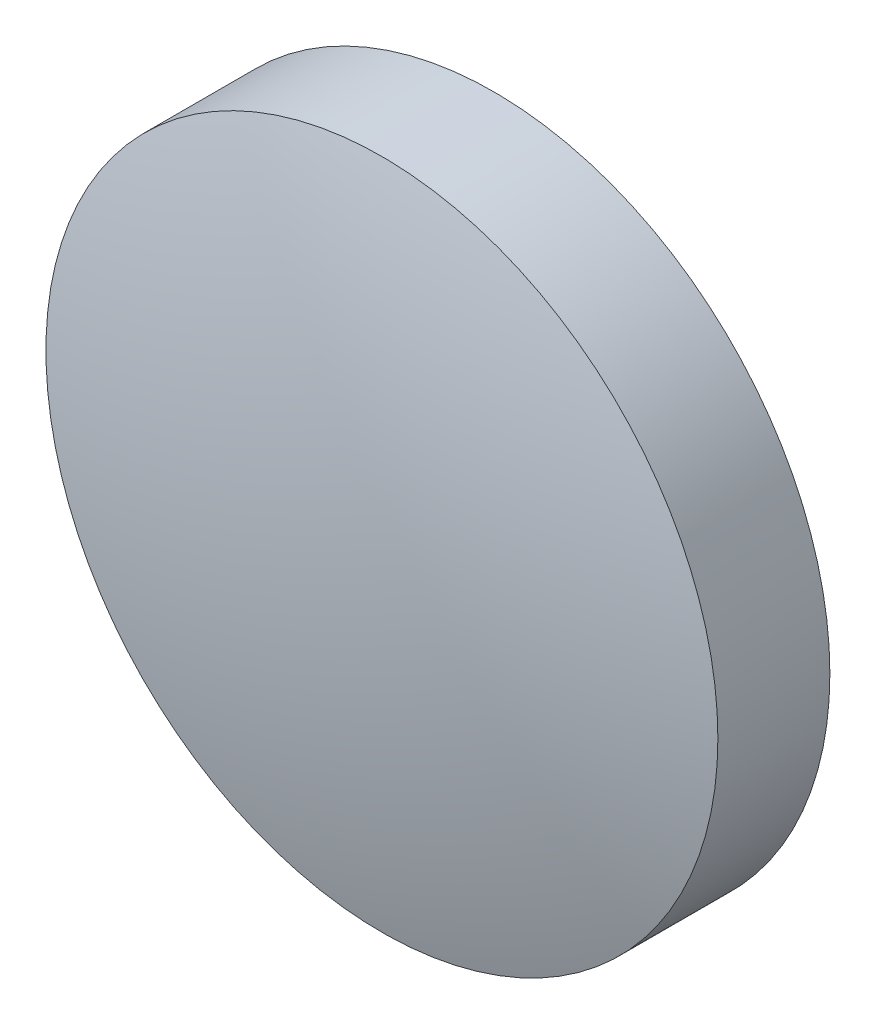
from build123d import *

# Parameters (mm, degrees)
SKIZZE1_R                       = 15
AUFSATZ_LINEAR_AUSTRAGEN1_DEPTH = 5
KUPPEL1_FACE_RADIUS             = 15
KUPPEL1_HEIGHT                  = 2
KUPPEL2_FACE_RADIUS             = 15
KUPPEL2_HEIGHT                  = 2


with BuildPart() as part:
    # Skizze1 → Aufsatz-Linear austragen1 (new body)
    with BuildSketch(Plane.XY):
        Circle(SKIZZE1_R)
    extrude(amount=AUFSATZ_LINEAR_AUSTRAGEN1_DEPTH)

    # Kuppel1: a dome of height H over a round flat face of radius A is a cap of a sphere of radius (A * A + H * H) / (2 * H)
    kuppel1_r = (KUPPEL1_FACE_RADIUS * KUPPEL1_FACE_RADIUS + KUPPEL1_HEIGHT * KUPPEL1_HEIGHT) / (2 * KUPPEL1_HEIGHT)
    kuppel1_base = Plane((0, 0, 5), z_dir=(0, 0, 1))
    with Locations(kuppel1_base.offset(KUPPEL1_HEIGHT - kuppel1_r)):
        kuppel1_ball = Sphere(kuppel1_r, mode=Mode.PRIVATE)
    add(split(kuppel1_ball, bisect_by=kuppel1_base, keep=Keep.TOP, mode=Mode.PRIVATE))

    # Kuppel2: a dome of height H over a round flat face of radius A is a cap of a sphere of radius (A * A + H * H) / (2 * H)
    kuppel2_r = (KUPPEL2_FACE_RADIUS * KUPPEL2_FACE_RADIUS + KUPPEL2_HEIGHT * KUPPEL2_HEIGHT) / (2 * KUPPEL2_HEIGHT)
    kuppel2_base = Plane((0, 0, 0), z_dir=(0, 0, 1))
    with Locations(kuppel2_base.offset(KUPPEL2_HEIGHT - kuppel2_r)):
        kuppel2_ball = Sphere(kuppel2_r, mode=Mode.PRIVATE)
    add(split(kuppel2_ball, bisect_by=kuppel2_base, keep=Keep.TOP, mode=Mode.PRIVATE), mode=Mode.SUBTRACT)


solid = part.part
